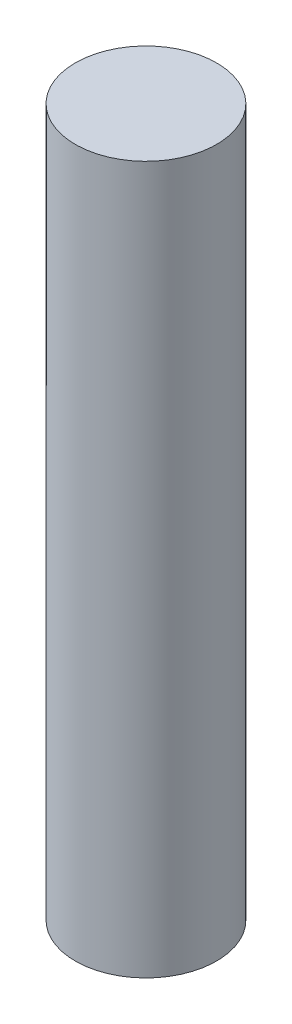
from build123d import *

# Parameters (mm, degrees)
ESQUISSE1_W = 2.269
ESQUISSE1_H = 22.71


with BuildPart() as part:
    # Esquisse1 → R_volution1 (revolve)
    with BuildSketch(Plane.XY, mode=Mode.PRIVATE) as r_volution1_sk:
        with Locations((-40.708178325, 23.82243561)):
            Rectangle(ESQUISSE1_W, ESQUISSE1_H)
    revolve(r_volution1_sk.sketch.rotate(Axis((-41.842678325, 35.17743561, 0), (0, -1, 0)), 180), axis=Axis((-41.842678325, 35.17743561, 0), (0, -1, 0)))


solid = part.part
